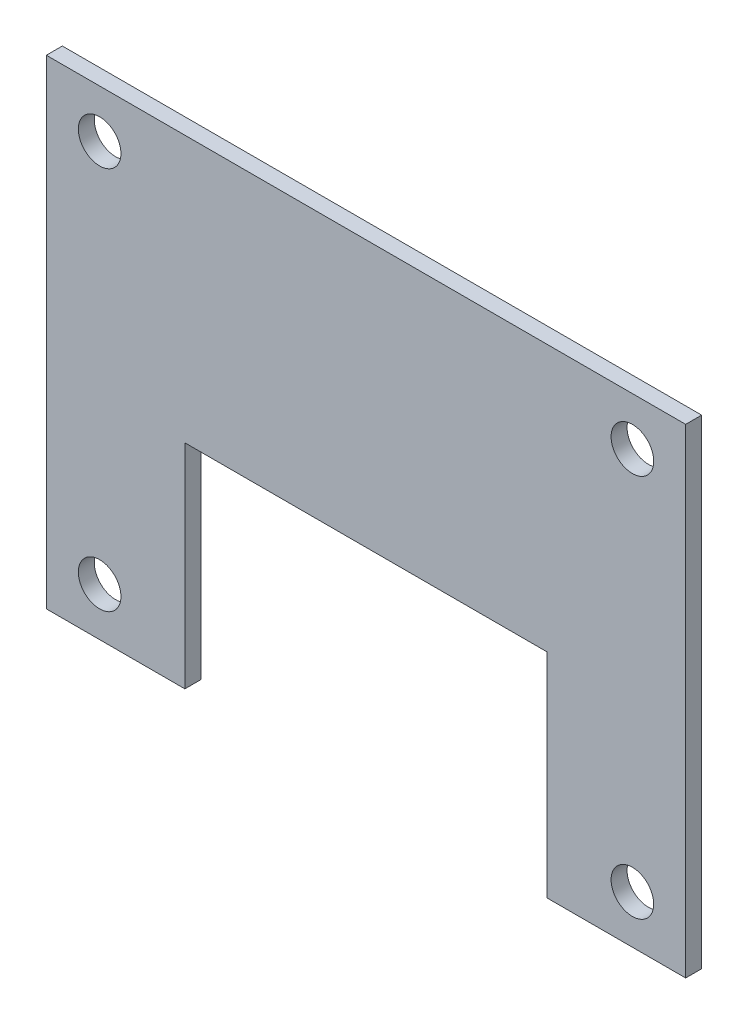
from build123d import *

# Parameters (mm, degrees)
ESQUISSE1_R      = 2
EXTRUSION1_DEPTH = 1.5


with BuildPart() as part:
    # Esquisse1 → Extrusion1 (new body)
    with BuildSketch(Plane.XY):
        Polygon((0, 0), (0, 45), (60, 45), (60, 0), (47, 0), (47, 20), (13, 20), (13, 0), align=None)
        with Locations((5, 40.5)):
            Circle(ESQUISSE1_R, mode=Mode.SUBTRACT)
        with Locations((55, 40.5)):
            Circle(ESQUISSE1_R, mode=Mode.SUBTRACT)
        with Locations((55, 4.5)):
            Circle(ESQUISSE1_R, mode=Mode.SUBTRACT)
        with Locations((5, 4.5)):
            Circle(ESQUISSE1_R, mode=Mode.SUBTRACT)
    extrude(amount=EXTRUSION1_DEPTH)


solid = part.part
